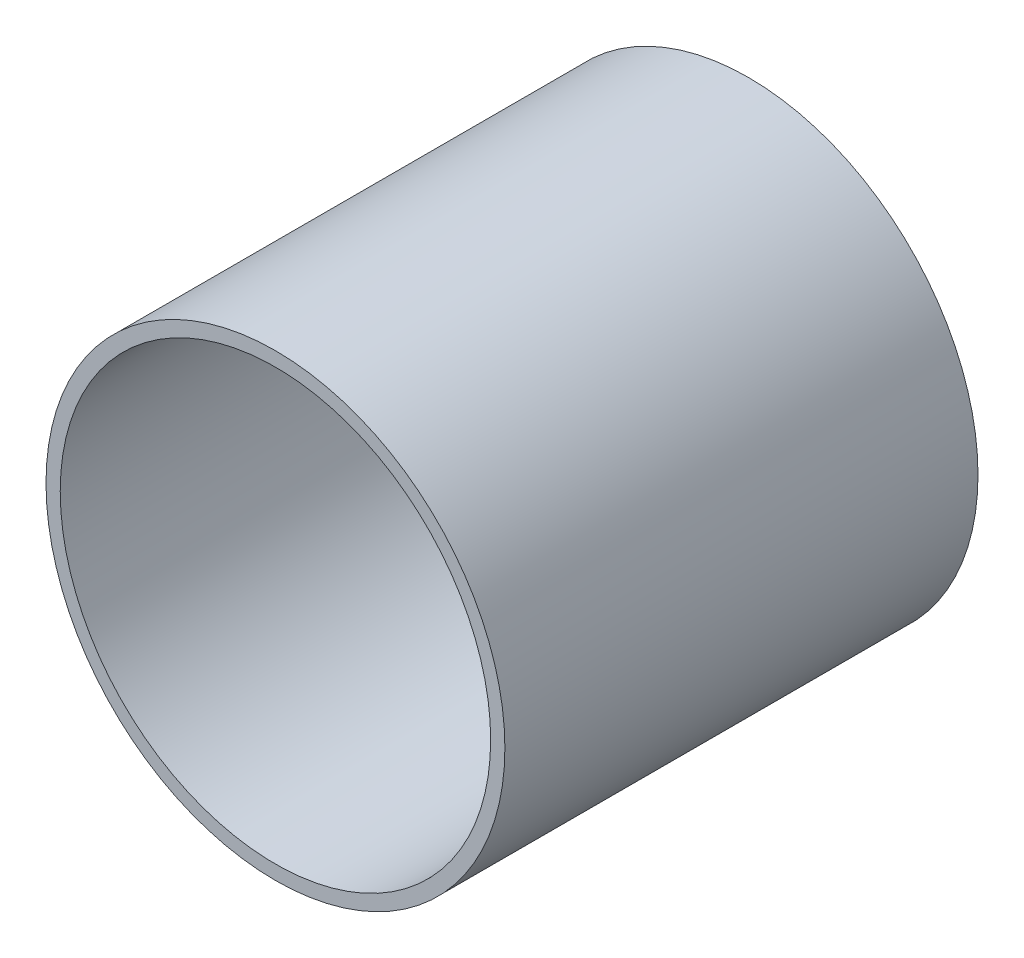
from build123d import *

# Parameters (mm, degrees)
SKETCH1_R   = 25.4
END_DEPTH   = 1.5748
SKETCH2_R   = 25.4
SKETCH2_R_2 = 23.8252
BODY_DEPTH  = 50.8


with BuildPart() as part:
    # Sketch1 → end (new body)
    with BuildSketch(Plane.XY):
        Circle(SKETCH1_R)
    extrude(amount=END_DEPTH)

    # Sketch2 → body (add)
    with BuildSketch(Plane.XY.offset(1.5748)):
        Circle(SKETCH2_R)
        Circle(SKETCH2_R_2, mode=Mode.SUBTRACT)
    extrude(amount=BODY_DEPTH)


solid = part.part
